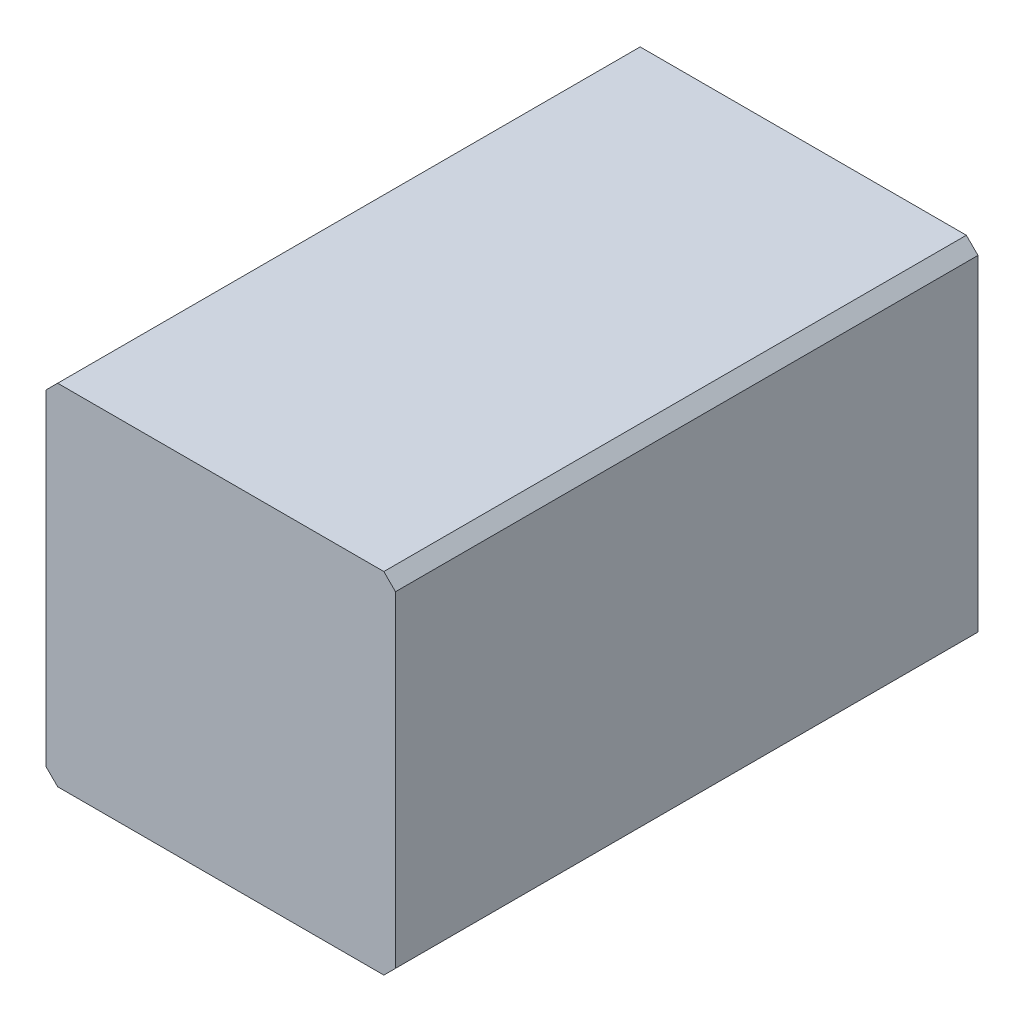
ISO-10303-21;
HEADER;
FILE_DESCRIPTION(('STEP AP214'),'2;1');
FILE_NAME('part.step','',(''),(''),'','','');
FILE_SCHEMA(('AUTOMOTIVE_DESIGN { 1 0 10303 214 1 1 1 1 }'));
ENDSEC;
DATA;
#1=APPLICATION_CONTEXT('core data for automotive mechanical design processes');
#2=APPLICATION_PROTOCOL_DEFINITION('international standard','automotive_design',2000,#1);
#3=PRODUCT_CONTEXT('',#1,'mechanical');
#4=PRODUCT('Part','Part','',(#3));
#5=PRODUCT_RELATED_PRODUCT_CATEGORY('part','',(#4));
#6=PRODUCT_DEFINITION_FORMATION('','',#4);
#7=PRODUCT_DEFINITION_CONTEXT('part definition',#1,'design');
#8=PRODUCT_DEFINITION('design','',#6,#7);
#9=PRODUCT_DEFINITION_SHAPE('','',#8);
#10=(LENGTH_UNIT() NAMED_UNIT(*) SI_UNIT(.MILLI.,.METRE.));
#11=(NAMED_UNIT(*) PLANE_ANGLE_UNIT() SI_UNIT($,.RADIAN.));
#12=(NAMED_UNIT(*) SI_UNIT($,.STERADIAN.) SOLID_ANGLE_UNIT());
#13=UNCERTAINTY_MEASURE_WITH_UNIT(LENGTH_MEASURE(1.E-05),#10,'distance_accuracy_value','');
#14=(GEOMETRIC_REPRESENTATION_CONTEXT(3) GLOBAL_UNCERTAINTY_ASSIGNED_CONTEXT((#13)) GLOBAL_UNIT_ASSIGNED_CONTEXT((#10,
#11,#12)) REPRESENTATION_CONTEXT('',''));
#15=CARTESIAN_POINT('',(0.,0.,0.));
#16=DIRECTION('',(0.,0.,1.));
#17=DIRECTION('',(1.,0.,0.));
#18=AXIS2_PLACEMENT_3D('',#15,#16,#17);
#19=CARTESIAN_POINT('',(-3.,-3.,5.));
#20=DIRECTION('',(1.,0.,0.));
#21=DIRECTION('',(0.,0.,-1.));
#22=AXIS2_PLACEMENT_3D('',#19,#20,#21);
#23=PLANE('',#22);
#24=DIRECTION('',(0.,-1.,0.));
#25=VECTOR('',#24,1.);
#26=CARTESIAN_POINT('',(-3.,-3.,-5.));
#27=LINE('',#26,#25);
#28=CARTESIAN_POINT('',(-3.,2.8,-5.));
#29=VERTEX_POINT('',#28);
#30=CARTESIAN_POINT('',(-3.,-2.8,-5.));
#31=VERTEX_POINT('',#30);
#32=EDGE_CURVE('E123',#29,#31,#27,.T.);
#33=ORIENTED_EDGE('',*,*,#32,.T.);
#34=DIRECTION('',(0.,0.,1.));
#35=VECTOR('',#34,1.);
#36=CARTESIAN_POINT('',(-3.,-2.8,5.));
#37=LINE('',#36,#35);
#38=CARTESIAN_POINT('',(-3.,-2.8,5.));
#39=VERTEX_POINT('',#38);
#40=EDGE_CURVE('E101',#31,#39,#37,.T.);
#41=ORIENTED_EDGE('',*,*,#40,.T.);
#42=DIRECTION('',(0.,-1.,0.));
#43=VECTOR('',#42,1.);
#44=CARTESIAN_POINT('',(-3.,-3.,5.));
#45=LINE('',#44,#43);
#46=CARTESIAN_POINT('',(-3.,2.8,5.));
#47=VERTEX_POINT('',#46);
#48=EDGE_CURVE('E131',#47,#39,#45,.T.);
#49=ORIENTED_EDGE('',*,*,#48,.F.);
#50=DIRECTION('',(0.,0.,-1.));
#51=VECTOR('',#50,1.);
#52=CARTESIAN_POINT('',(-3.,2.8,5.));
#53=LINE('',#52,#51);
#54=EDGE_CURVE('E106',#47,#29,#53,.T.);
#55=ORIENTED_EDGE('',*,*,#54,.T.);
#56=EDGE_LOOP('',(#33,#41,#49,#55));
#57=FACE_BOUND('',#56,.T.);
#58=ADVANCED_FACE('F32',(#57),#23,.F.);
#59=CARTESIAN_POINT('',(-3.,-3.,5.));
#60=DIRECTION('',(0.,1.,0.));
#61=DIRECTION('',(0.,0.,1.));
#62=AXIS2_PLACEMENT_3D('',#59,#60,#61);
#63=PLANE('',#62);
#64=DIRECTION('',(1.,0.,0.));
#65=VECTOR('',#64,1.);
#66=CARTESIAN_POINT('',(-3.,-3.,5.));
#67=LINE('',#66,#65);
#68=CARTESIAN_POINT('',(-2.8,-3.,5.));
#69=VERTEX_POINT('',#68);
#70=CARTESIAN_POINT('',(2.8,-3.,5.));
#71=VERTEX_POINT('',#70);
#72=EDGE_CURVE('E116',#69,#71,#67,.T.);
#73=ORIENTED_EDGE('',*,*,#72,.F.);
#74=DIRECTION('',(0.,0.,-1.));
#75=VECTOR('',#74,1.);
#76=CARTESIAN_POINT('',(-2.8,-3.,5.));
#77=LINE('',#76,#75);
#78=CARTESIAN_POINT('',(-2.8,-3.,-5.));
#79=VERTEX_POINT('',#78);
#80=EDGE_CURVE('E100',#69,#79,#77,.T.);
#81=ORIENTED_EDGE('',*,*,#80,.T.);
#82=DIRECTION('',(1.,0.,0.));
#83=VECTOR('',#82,1.);
#84=CARTESIAN_POINT('',(-3.,-3.,-5.));
#85=LINE('',#84,#83);
#86=CARTESIAN_POINT('',(2.8,-3.,-5.));
#87=VERTEX_POINT('',#86);
#88=EDGE_CURVE('E113',#79,#87,#85,.T.);
#89=ORIENTED_EDGE('',*,*,#88,.T.);
#90=DIRECTION('',(0.,0.,1.));
#91=VECTOR('',#90,1.);
#92=CARTESIAN_POINT('',(2.8,-3.,5.));
#93=LINE('',#92,#91);
#94=EDGE_CURVE('E118',#87,#71,#93,.T.);
#95=ORIENTED_EDGE('',*,*,#94,.T.);
#96=EDGE_LOOP('',(#73,#81,#89,#95));
#97=FACE_BOUND('',#96,.T.);
#98=ADVANCED_FACE('F112',(#97),#63,.F.);
#99=CARTESIAN_POINT('',(3.,-3.,5.));
#100=DIRECTION('',(-1.,0.,0.));
#101=DIRECTION('',(0.,0.,1.));
#102=AXIS2_PLACEMENT_3D('',#99,#100,#101);
#103=PLANE('',#102);
#104=DIRECTION('',(0.,1.,0.));
#105=VECTOR('',#104,1.);
#106=CARTESIAN_POINT('',(3.,-3.,5.));
#107=LINE('',#106,#105);
#108=CARTESIAN_POINT('',(3.,-2.8,5.));
#109=VERTEX_POINT('',#108);
#110=CARTESIAN_POINT('',(3.,2.8,5.));
#111=VERTEX_POINT('',#110);
#112=EDGE_CURVE('E135',#109,#111,#107,.T.);
#113=ORIENTED_EDGE('',*,*,#112,.F.);
#114=DIRECTION('',(0.,0.,-1.));
#115=VECTOR('',#114,1.);
#116=CARTESIAN_POINT('',(3.,-2.8,5.));
#117=LINE('',#116,#115);
#118=CARTESIAN_POINT('',(3.,-2.8,-5.));
#119=VERTEX_POINT('',#118);
#120=EDGE_CURVE('E156',#109,#119,#117,.T.);
#121=ORIENTED_EDGE('',*,*,#120,.T.);
#122=DIRECTION('',(0.,1.,0.));
#123=VECTOR('',#122,1.);
#124=CARTESIAN_POINT('',(3.,-3.,-5.));
#125=LINE('',#124,#123);
#126=CARTESIAN_POINT('',(3.,2.8,-5.));
#127=VERTEX_POINT('',#126);
#128=EDGE_CURVE('E122',#119,#127,#125,.T.);
#129=ORIENTED_EDGE('',*,*,#128,.T.);
#130=DIRECTION('',(0.,0.,1.));
#131=VECTOR('',#130,1.);
#132=CARTESIAN_POINT('',(3.,2.8,5.));
#133=LINE('',#132,#131);
#134=EDGE_CURVE('E154',#127,#111,#133,.T.);
#135=ORIENTED_EDGE('',*,*,#134,.T.);
#136=EDGE_LOOP('',(#113,#121,#129,#135));
#137=FACE_BOUND('',#136,.T.);
#138=ADVANCED_FACE('F176',(#137),#103,.F.);
#139=CARTESIAN_POINT('',(-3.,3.,5.));
#140=DIRECTION('',(0.,-1.,0.));
#141=DIRECTION('',(0.,0.,-1.));
#142=AXIS2_PLACEMENT_3D('',#139,#140,#141);
#143=PLANE('',#142);
#144=DIRECTION('',(-1.,0.,0.));
#145=VECTOR('',#144,1.);
#146=CARTESIAN_POINT('',(-3.,3.,-5.));
#147=LINE('',#146,#145);
#148=CARTESIAN_POINT('',(2.8,3.,-5.));
#149=VERTEX_POINT('',#148);
#150=CARTESIAN_POINT('',(-2.8,3.,-5.));
#151=VERTEX_POINT('',#150);
#152=EDGE_CURVE('E126',#149,#151,#147,.T.);
#153=ORIENTED_EDGE('',*,*,#152,.T.);
#154=DIRECTION('',(0.,0.,1.));
#155=VECTOR('',#154,1.);
#156=CARTESIAN_POINT('',(-2.8,3.,5.));
#157=LINE('',#156,#155);
#158=CARTESIAN_POINT('',(-2.8,3.,5.));
#159=VERTEX_POINT('',#158);
#160=EDGE_CURVE('E11',#151,#159,#157,.T.);
#161=ORIENTED_EDGE('',*,*,#160,.T.);
#162=DIRECTION('',(-1.,0.,0.));
#163=VECTOR('',#162,1.);
#164=CARTESIAN_POINT('',(-3.,3.,5.));
#165=LINE('',#164,#163);
#166=CARTESIAN_POINT('',(2.8,3.,5.));
#167=VERTEX_POINT('',#166);
#168=EDGE_CURVE('E137',#167,#159,#165,.T.);
#169=ORIENTED_EDGE('',*,*,#168,.F.);
#170=DIRECTION('',(0.,0.,-1.));
#171=VECTOR('',#170,1.);
#172=CARTESIAN_POINT('',(2.8,3.,5.));
#173=LINE('',#172,#171);
#174=EDGE_CURVE('E39',#167,#149,#173,.T.);
#175=ORIENTED_EDGE('',*,*,#174,.T.);
#176=EDGE_LOOP('',(#153,#161,#169,#175));
#177=FACE_BOUND('',#176,.T.);
#178=ADVANCED_FACE('F161',(#177),#143,.F.);
#179=CARTESIAN_POINT('',(-3.,3.,5.));
#180=DIRECTION('',(0.,0.,-1.));
#181=DIRECTION('',(-1.,0.,0.));
#182=AXIS2_PLACEMENT_3D('',#179,#180,#181);
#183=PLANE('',#182);
#184=ORIENTED_EDGE('',*,*,#48,.T.);
#185=DIRECTION('',(-0.707106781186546,0.707106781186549,0.));
#186=VECTOR('',#185,1.);
#187=CARTESIAN_POINT('',(-2.8,-3.,5.));
#188=LINE('',#187,#186);
#189=EDGE_CURVE('E152',#39,#69,#188,.F.);
#190=ORIENTED_EDGE('',*,*,#189,.T.);
#191=ORIENTED_EDGE('',*,*,#72,.T.);
#192=DIRECTION('',(-0.707106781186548,-0.707106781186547,0.));
#193=VECTOR('',#192,1.);
#194=CARTESIAN_POINT('',(3.,-2.8,5.));
#195=LINE('',#194,#193);
#196=EDGE_CURVE('E150',#71,#109,#195,.F.);
#197=ORIENTED_EDGE('',*,*,#196,.T.);
#198=ORIENTED_EDGE('',*,*,#112,.T.);
#199=DIRECTION('',(0.707106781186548,-0.707106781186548,0.));
#200=VECTOR('',#199,1.);
#201=CARTESIAN_POINT('',(2.8,3.,5.));
#202=LINE('',#201,#200);
#203=EDGE_CURVE('E51',#111,#167,#202,.F.);
#204=ORIENTED_EDGE('',*,*,#203,.T.);
#205=ORIENTED_EDGE('',*,*,#168,.T.);
#206=DIRECTION('',(0.707106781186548,0.707106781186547,0.));
#207=VECTOR('',#206,1.);
#208=CARTESIAN_POINT('',(-3.,2.8,5.));
#209=LINE('',#208,#207);
#210=EDGE_CURVE('E148',#159,#47,#209,.F.);
#211=ORIENTED_EDGE('',*,*,#210,.T.);
#212=EDGE_LOOP('',(#184,#190,#191,#197,#198,#204,#205,#211));
#213=FACE_BOUND('',#212,.T.);
#214=ADVANCED_FACE('F169',(#213),#183,.F.);
#215=CARTESIAN_POINT('',(-3.,3.,-5.));
#216=DIRECTION('',(0.,0.,-1.));
#217=DIRECTION('',(-1.,0.,0.));
#218=AXIS2_PLACEMENT_3D('',#215,#216,#217);
#219=PLANE('',#218);
#220=ORIENTED_EDGE('',*,*,#88,.F.);
#221=DIRECTION('',(0.707106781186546,-0.707106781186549,0.));
#222=VECTOR('',#221,1.);
#223=CARTESIAN_POINT('',(-5.9,0.100000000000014,-5.));
#224=LINE('',#223,#222);
#225=EDGE_CURVE('E96',#79,#31,#224,.F.);
#226=ORIENTED_EDGE('',*,*,#225,.T.);
#227=ORIENTED_EDGE('',*,*,#32,.F.);
#228=DIRECTION('',(-0.707106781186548,-0.707106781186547,0.));
#229=VECTOR('',#228,1.);
#230=CARTESIAN_POINT('',(-2.9,2.9,-5.));
#231=LINE('',#230,#229);
#232=EDGE_CURVE('E141',#29,#151,#231,.F.);
#233=ORIENTED_EDGE('',*,*,#232,.T.);
#234=ORIENTED_EDGE('',*,*,#152,.F.);
#235=DIRECTION('',(-0.707106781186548,0.707106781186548,0.));
#236=VECTOR('',#235,1.);
#237=CARTESIAN_POINT('',(-0.1,5.9,-5.));
#238=LINE('',#237,#236);
#239=EDGE_CURVE('E117',#149,#127,#238,.F.);
#240=ORIENTED_EDGE('',*,*,#239,.T.);
#241=ORIENTED_EDGE('',*,*,#128,.F.);
#242=DIRECTION('',(0.707106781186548,0.707106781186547,0.));
#243=VECTOR('',#242,1.);
#244=CARTESIAN_POINT('',(2.89999999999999,-2.9,-5.));
#245=LINE('',#244,#243);
#246=EDGE_CURVE('E107',#119,#87,#245,.F.);
#247=ORIENTED_EDGE('',*,*,#246,.T.);
#248=EDGE_LOOP('',(#220,#226,#227,#233,#234,#240,#241,#247));
#249=FACE_BOUND('',#248,.T.);
#250=ADVANCED_FACE('F120',(#249),#219,.T.);
#251=CARTESIAN_POINT('',(-2.8,-3.,5.));
#252=DIRECTION('',(0.707106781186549,0.707106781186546,0.));
#253=DIRECTION('',(-0.707106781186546,0.707106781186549,0.));
#254=AXIS2_PLACEMENT_3D('',#251,#252,#253);
#255=PLANE('',#254);
#256=ORIENTED_EDGE('',*,*,#189,.F.);
#257=ORIENTED_EDGE('',*,*,#40,.F.);
#258=ORIENTED_EDGE('',*,*,#225,.F.);
#259=ORIENTED_EDGE('',*,*,#80,.F.);
#260=EDGE_LOOP('',(#256,#257,#258,#259));
#261=FACE_BOUND('',#260,.T.);
#262=ADVANCED_FACE('F99',(#261),#255,.F.);
#263=CARTESIAN_POINT('',(3.,-2.8,5.));
#264=DIRECTION('',(-0.707106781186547,0.707106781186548,0.));
#265=DIRECTION('',(-0.707106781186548,-0.707106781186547,0.));
#266=AXIS2_PLACEMENT_3D('',#263,#264,#265);
#267=PLANE('',#266);
#268=ORIENTED_EDGE('',*,*,#196,.F.);
#269=ORIENTED_EDGE('',*,*,#94,.F.);
#270=ORIENTED_EDGE('',*,*,#246,.F.);
#271=ORIENTED_EDGE('',*,*,#120,.F.);
#272=EDGE_LOOP('',(#268,#269,#270,#271));
#273=FACE_BOUND('',#272,.T.);
#274=ADVANCED_FACE('F174',(#273),#267,.F.);
#275=CARTESIAN_POINT('',(-3.,2.8,5.));
#276=DIRECTION('',(0.707106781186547,-0.707106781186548,0.));
#277=DIRECTION('',(0.707106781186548,0.707106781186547,0.));
#278=AXIS2_PLACEMENT_3D('',#275,#276,#277);
#279=PLANE('',#278);
#280=ORIENTED_EDGE('',*,*,#210,.F.);
#281=ORIENTED_EDGE('',*,*,#160,.F.);
#282=ORIENTED_EDGE('',*,*,#232,.F.);
#283=ORIENTED_EDGE('',*,*,#54,.F.);
#284=EDGE_LOOP('',(#280,#281,#282,#283));
#285=FACE_BOUND('',#284,.T.);
#286=ADVANCED_FACE('F166',(#285),#279,.F.);
#287=CARTESIAN_POINT('',(2.8,3.,5.));
#288=DIRECTION('',(-0.707106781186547,-0.707106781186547,0.));
#289=DIRECTION('',(0.707106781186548,-0.707106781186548,0.));
#290=AXIS2_PLACEMENT_3D('',#287,#288,#289);
#291=PLANE('',#290);
#292=ORIENTED_EDGE('',*,*,#203,.F.);
#293=ORIENTED_EDGE('',*,*,#134,.F.);
#294=ORIENTED_EDGE('',*,*,#239,.F.);
#295=ORIENTED_EDGE('',*,*,#174,.F.);
#296=EDGE_LOOP('',(#292,#293,#294,#295));
#297=FACE_BOUND('',#296,.T.);
#298=ADVANCED_FACE('F178',(#297),#291,.F.);
#299=CLOSED_SHELL('',(#58,#98,#138,#178,#214,#250,#262,#274,#286,#298));
#300=MANIFOLD_SOLID_BREP('B2',#299);
#301=ADVANCED_BREP_SHAPE_REPRESENTATION('',(#18,#300),#14);
#302=SHAPE_DEFINITION_REPRESENTATION(#9,#301);
ENDSEC;
END-ISO-10303-21;
